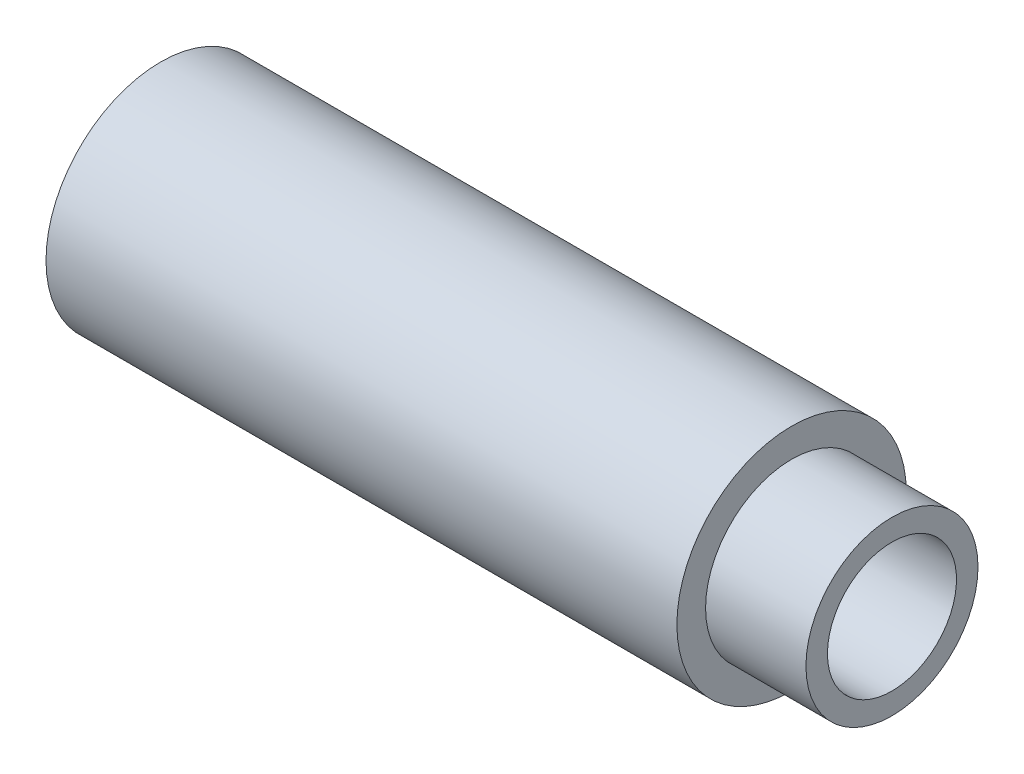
ISO-10303-21;
HEADER;
FILE_DESCRIPTION(('STEP AP214'),'2;1');
FILE_NAME('part.step','',(''),(''),'','','');
FILE_SCHEMA(('AUTOMOTIVE_DESIGN { 1 0 10303 214 1 1 1 1 }'));
ENDSEC;
DATA;
#1=APPLICATION_CONTEXT('core data for automotive mechanical design processes');
#2=APPLICATION_PROTOCOL_DEFINITION('international standard','automotive_design',2000,#1);
#3=PRODUCT_CONTEXT('',#1,'mechanical');
#4=PRODUCT('Part','Part','',(#3));
#5=PRODUCT_RELATED_PRODUCT_CATEGORY('part','',(#4));
#6=PRODUCT_DEFINITION_FORMATION('','',#4);
#7=PRODUCT_DEFINITION_CONTEXT('part definition',#1,'design');
#8=PRODUCT_DEFINITION('design','',#6,#7);
#9=PRODUCT_DEFINITION_SHAPE('','',#8);
#10=(LENGTH_UNIT() NAMED_UNIT(*) SI_UNIT(.MILLI.,.METRE.));
#11=(NAMED_UNIT(*) PLANE_ANGLE_UNIT() SI_UNIT($,.RADIAN.));
#12=(NAMED_UNIT(*) SI_UNIT($,.STERADIAN.) SOLID_ANGLE_UNIT());
#13=UNCERTAINTY_MEASURE_WITH_UNIT(LENGTH_MEASURE(1.E-05),#10,'distance_accuracy_value','');
#14=(GEOMETRIC_REPRESENTATION_CONTEXT(3) GLOBAL_UNCERTAINTY_ASSIGNED_CONTEXT((#13)) GLOBAL_UNIT_ASSIGNED_CONTEXT((#10,
#11,#12)) REPRESENTATION_CONTEXT('',''));
#15=CARTESIAN_POINT('',(0.,0.,0.));
#16=DIRECTION('',(0.,0.,1.));
#17=DIRECTION('',(1.,0.,0.));
#18=AXIS2_PLACEMENT_3D('',#15,#16,#17);
#19=CARTESIAN_POINT('',(0.,2.25,0.));
#20=DIRECTION('',(1.,0.,0.));
#21=DIRECTION('',(0.,0.,-1.));
#22=AXIS2_PLACEMENT_3D('',#19,#20,#21);
#23=PLANE('',#22);
#24=CARTESIAN_POINT('',(0.,0.,0.));
#25=DIRECTION('',(-1.,0.,0.));
#26=DIRECTION('',(0.,0.,1.));
#27=AXIS2_PLACEMENT_3D('',#24,#25,#26);
#28=CIRCLE('',#27,2.25);
#29=CARTESIAN_POINT('',(0.,0.,2.25));
#30=VERTEX_POINT('',#29);
#31=EDGE_CURVE('E51',#30,#30,#28,.T.);
#32=ORIENTED_EDGE('',*,*,#31,.F.);
#33=EDGE_LOOP('',(#32));
#34=FACE_BOUND('',#33,.T.);
#35=CARTESIAN_POINT('',(0.,0.,0.));
#36=DIRECTION('',(-1.,0.,0.));
#37=DIRECTION('',(0.,0.,1.));
#38=AXIS2_PLACEMENT_3D('',#35,#36,#37);
#39=CIRCLE('',#38,4.);
#40=CARTESIAN_POINT('',(0.,0.,4.));
#41=VERTEX_POINT('',#40);
#42=EDGE_CURVE('E10',#41,#41,#39,.T.);
#43=ORIENTED_EDGE('',*,*,#42,.T.);
#44=EDGE_LOOP('',(#43));
#45=FACE_BOUND('',#44,.T.);
#46=ADVANCED_FACE('F29',(#34,#45),#23,.F.);
#47=CARTESIAN_POINT('',(0.,0.,0.));
#48=DIRECTION('',(-1.,0.,0.));
#49=DIRECTION('',(0.,0.,1.));
#50=AXIS2_PLACEMENT_3D('',#47,#48,#49);
#51=CYLINDRICAL_SURFACE('',#50,4.);
#52=ORIENTED_EDGE('',*,*,#42,.F.);
#53=EDGE_LOOP('',(#52));
#54=FACE_BOUND('',#53,.T.);
#55=CARTESIAN_POINT('',(22.,0.,0.));
#56=DIRECTION('',(-1.,0.,0.));
#57=DIRECTION('',(0.,0.,1.));
#58=AXIS2_PLACEMENT_3D('',#55,#56,#57);
#59=CIRCLE('',#58,4.);
#60=CARTESIAN_POINT('',(22.,0.,4.));
#61=VERTEX_POINT('',#60);
#62=EDGE_CURVE('E35',#61,#61,#59,.T.);
#63=ORIENTED_EDGE('',*,*,#62,.T.);
#64=EDGE_LOOP('',(#63));
#65=FACE_BOUND('',#64,.T.);
#66=ADVANCED_FACE('F58',(#54,#65),#51,.T.);
#67=CARTESIAN_POINT('',(22.,4.,0.));
#68=DIRECTION('',(-1.,0.,0.));
#69=DIRECTION('',(0.,0.,1.));
#70=AXIS2_PLACEMENT_3D('',#67,#68,#69);
#71=PLANE('',#70);
#72=ORIENTED_EDGE('',*,*,#62,.F.);
#73=EDGE_LOOP('',(#72));
#74=FACE_BOUND('',#73,.T.);
#75=CARTESIAN_POINT('',(22.,0.,0.));
#76=DIRECTION('',(-1.,0.,0.));
#77=DIRECTION('',(0.,0.,1.));
#78=AXIS2_PLACEMENT_3D('',#75,#76,#77);
#79=CIRCLE('',#78,3.);
#80=CARTESIAN_POINT('',(22.,0.,3.));
#81=VERTEX_POINT('',#80);
#82=EDGE_CURVE('E39',#81,#81,#79,.T.);
#83=ORIENTED_EDGE('',*,*,#82,.T.);
#84=EDGE_LOOP('',(#83));
#85=FACE_BOUND('',#84,.T.);
#86=ADVANCED_FACE('F62',(#74,#85),#71,.F.);
#87=CARTESIAN_POINT('',(0.,0.,0.));
#88=DIRECTION('',(-1.,0.,0.));
#89=DIRECTION('',(0.,0.,1.));
#90=AXIS2_PLACEMENT_3D('',#87,#88,#89);
#91=CYLINDRICAL_SURFACE('',#90,3.);
#92=ORIENTED_EDGE('',*,*,#82,.F.);
#93=EDGE_LOOP('',(#92));
#94=FACE_BOUND('',#93,.T.);
#95=CARTESIAN_POINT('',(25.5,0.,0.));
#96=DIRECTION('',(-1.,0.,0.));
#97=DIRECTION('',(0.,0.,1.));
#98=AXIS2_PLACEMENT_3D('',#95,#96,#97);
#99=CIRCLE('',#98,3.);
#100=CARTESIAN_POINT('',(25.5,0.,3.));
#101=VERTEX_POINT('',#100);
#102=EDGE_CURVE('E43',#101,#101,#99,.T.);
#103=ORIENTED_EDGE('',*,*,#102,.T.);
#104=EDGE_LOOP('',(#103));
#105=FACE_BOUND('',#104,.T.);
#106=ADVANCED_FACE('F67',(#94,#105),#91,.T.);
#107=CARTESIAN_POINT('',(25.5,3.,0.));
#108=DIRECTION('',(-1.,0.,0.));
#109=DIRECTION('',(0.,0.,1.));
#110=AXIS2_PLACEMENT_3D('',#107,#108,#109);
#111=PLANE('',#110);
#112=ORIENTED_EDGE('',*,*,#102,.F.);
#113=EDGE_LOOP('',(#112));
#114=FACE_BOUND('',#113,.T.);
#115=CARTESIAN_POINT('',(25.5,0.,0.));
#116=DIRECTION('',(-1.,0.,0.));
#117=DIRECTION('',(0.,0.,1.));
#118=AXIS2_PLACEMENT_3D('',#115,#116,#117);
#119=CIRCLE('',#118,2.25);
#120=CARTESIAN_POINT('',(25.5,0.,2.25));
#121=VERTEX_POINT('',#120);
#122=EDGE_CURVE('E48',#121,#121,#119,.T.);
#123=ORIENTED_EDGE('',*,*,#122,.T.);
#124=EDGE_LOOP('',(#123));
#125=FACE_BOUND('',#124,.T.);
#126=ADVANCED_FACE('F73',(#114,#125),#111,.F.);
#127=CARTESIAN_POINT('',(0.,0.,0.));
#128=DIRECTION('',(-1.,0.,0.));
#129=DIRECTION('',(0.,0.,1.));
#130=AXIS2_PLACEMENT_3D('',#127,#128,#129);
#131=CYLINDRICAL_SURFACE('',#130,2.25);
#132=ORIENTED_EDGE('',*,*,#122,.F.);
#133=EDGE_LOOP('',(#132));
#134=FACE_BOUND('',#133,.T.);
#135=ORIENTED_EDGE('',*,*,#31,.T.);
#136=EDGE_LOOP('',(#135));
#137=FACE_BOUND('',#136,.T.);
#138=ADVANCED_FACE('F55',(#134,#137),#131,.F.);
#139=CLOSED_SHELL('',(#46,#66,#86,#106,#126,#138));
#140=MANIFOLD_SOLID_BREP('B2',#139);
#141=ADVANCED_BREP_SHAPE_REPRESENTATION('',(#18,#140),#14);
#142=SHAPE_DEFINITION_REPRESENTATION(#9,#141);
ENDSEC;
END-ISO-10303-21;
